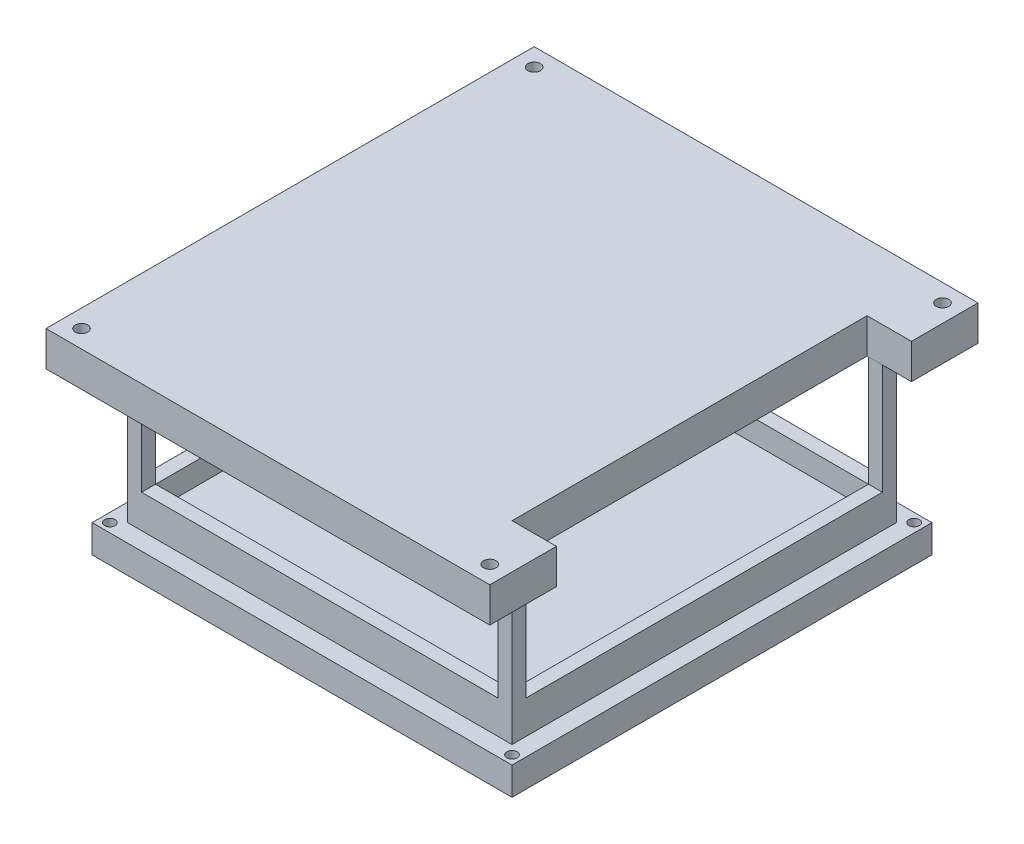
from build123d import *

# Parameters (mm, degrees)
SKETCH1_W           = 110
SKETCH1_H           = 110
BOSS_EXTRUDE1_DEPTH = 9.525
SKETCH3_W           = 120.16
SKETCH3_H           = 120.16
BOSS_EXTRUDE2_DEPTH = 8
SKETCH4_R           = 1.5
CUT_EXTRUDE2_DEPTH  = 86.498177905
SKETCH2_W           = 102
SKETCH2_H           = 102
CUT_EXTRUDE1_DEPTH  = 6.35
SKETCH5_W           = 4
SKETCH5_H           = 4
BOSS_EXTRUDE3_DEPTH = 31.75
SKETCH8_W           = 127
SKETCH8_H           = 139.7
BOSS_EXTRUDE4_DEPTH = 10
SKETCH11_R          = 1.778
CUT_EXTRUDE4_DEPTH  = 10
SKETCH13_W          = 12.7
SKETCH13_H          = 101.6
CUT_EXTRUDE5_DEPTH  = 10


with BuildPart() as part:
    # Sketch1 → Boss-Extrude1 (new body)
    with BuildSketch(Plane(origin=(0, 0, 0), x_dir=(1, 0, 0), z_dir=(0, 1, 0))):
        Rectangle(SKETCH1_W, SKETCH1_H)
    extrude(amount=BOSS_EXTRUDE1_DEPTH)

    # Sketch3 → Boss-Extrude2 (add)
    with BuildSketch(Plane.XZ):
        Rectangle(SKETCH3_W, SKETCH3_H)
    extrude(amount=BOSS_EXTRUDE2_DEPTH)

    # Sketch4 → Cut-Extrude2 (cut, through all)
    with BuildSketch(Plane(origin=(0, 0, 0), x_dir=(1, 0, 0), z_dir=(0, 1, 0))):
        with Locations(Location((-57.54, 57.54, 0), (0, 0, 270))):
            Circle(SKETCH4_R)
        with Locations(Location((57.54, 57.54, 0), (0, 0, 90))):
            Circle(SKETCH4_R)
        with Locations(Location((57.54, -57.54, 0), (0, 0, 270))):
            Circle(SKETCH4_R)
        with Locations(Location((-57.54, -57.54, 0), (0, 0, 90))):
            Circle(SKETCH4_R)
    extrude(amount=-CUT_EXTRUDE2_DEPTH, mode=Mode.SUBTRACT)

    # Sketch2 → Cut-Extrude1 (cut)
    with BuildSketch(Plane(origin=(0, 9.525, 0), x_dir=(1, 0, 0), z_dir=(0, 1, 0))):
        Rectangle(SKETCH2_W, SKETCH2_H)
    extrude(amount=-CUT_EXTRUDE1_DEPTH, mode=Mode.SUBTRACT)

    # Sketch5 → Boss-Extrude3 (add)
    with BuildSketch(Plane(origin=(0, 9.525, 0), x_dir=(1, 0, 0), z_dir=(0, 1, 0))):
        with Locations((-53, 53)):
            Rectangle(SKETCH5_W, SKETCH5_H)
        with Locations((-53, -53)):
            Rectangle(SKETCH5_W, SKETCH5_H)
        with Locations((53, -53)):
            Rectangle(SKETCH5_W, SKETCH5_H)
        with Locations((53, 53)):
            Rectangle(SKETCH5_W, SKETCH5_H)
    extrude(amount=BOSS_EXTRUDE3_DEPTH)

    # Sketch8 → Boss-Extrude4 (add)
    with BuildSketch(Plane(origin=(0, 41.275, 0), x_dir=(1, 0, 0), z_dir=(0, 1, 0))):
        Rectangle(SKETCH8_W, SKETCH8_H)
    extrude(amount=BOSS_EXTRUDE4_DEPTH)

    # Sketch11 → Cut-Extrude4 (cut)
    with BuildSketch(Plane(origin=(0, 41.275, 0), x_dir=(1, 0, 0), z_dir=(0, 1, 0))):
        with Locations(Location((-58.42, 64.77, 0), (0, 0, 270))):
            Circle(SKETCH11_R)
        with Locations(Location((58.42, 64.77, 0), (0, 0, 90))):
            Circle(SKETCH11_R)
        with Locations(Location((-58.42, -64.77, 0), (0, 0, 270))):
            Circle(SKETCH11_R)
        with Locations(Location((58.42, -64.77, 0), (0, 0, 90))):
            Circle(SKETCH11_R)
    extrude(amount=CUT_EXTRUDE4_DEPTH, mode=Mode.SUBTRACT)

    # Sketch13 → Cut-Extrude5 (cut)
    with BuildSketch(Plane(origin=(0, 51.275, 0), x_dir=(1, 0, 0), z_dir=(0, 1, 0))):
        with Locations((57.15, 0)):
            Rectangle(SKETCH13_W, SKETCH13_H)
    extrude(amount=-CUT_EXTRUDE5_DEPTH, mode=Mode.SUBTRACT)


solid = part.part
